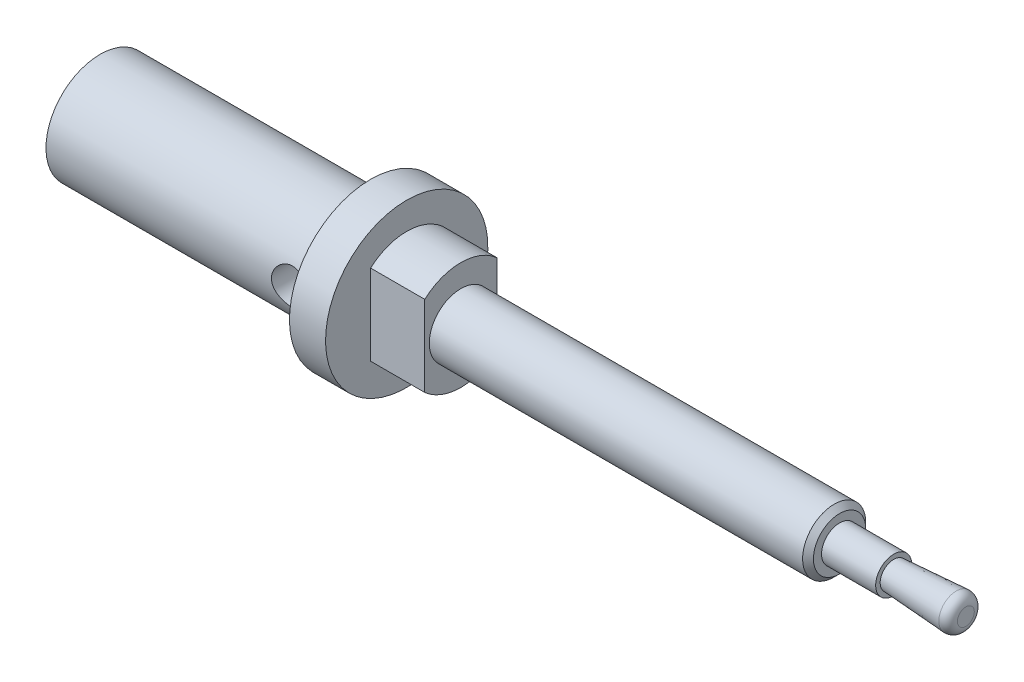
from build123d import *

# Parameters (mm, degrees)
CONG_1_R                     = 0.5
CHANFREIN1_SIZE              = 0.3
ENL_V_MAT_EXTRU_1_DEPTH      = 3
D_GAGEMENT_M41_D             = 4
D_GAGEMENT_M41_DEPTH         = 10
D_GAGEMENT_M41_TIP           = 1.201721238
ENL_V_MAT_EXTRU_2_DEPTH      = 34.608034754
ENL_V_MAT_EXTRU_2_DEPTH_BACK = 34.608034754
ESQUISSE5_R                  = 1


with BuildPart() as part:
    # Esquisse1 → R_volution1 (revolve)
    with BuildSketch(Plane.XY):
        Polygon((-15, 0), (-15, 3), (0, 3), (0, 4.5), (2, 4.5), (2, 3), (5, 3), (5, 1.75), (26, 1.75), (26, 1), (29, 1), (29, 0.75), (33, 1), (33, 0), align=None)
    revolve(axis=Axis((33, 0, 0), (-1, 0, 0)))

    # Cong_1
    cong_1_edges = [part.edges().sort_by_distance(p)[0] for p in [
        (33, -1, 0),
    ]]
    fillet(cong_1_edges, radius=CONG_1_R)

    # Chanfrein1
    chanfrein1_edges = [part.edges().sort_by_distance(p)[0] for p in [
        (26, -1.75, 0),
    ]]
    chamfer(chanfrein1_edges, length=CHANFREIN1_SIZE)

    # Esquisse2 → Enl_v. mat.-Extru.1 (cut)
    with BuildSketch(Plane(origin=(5, 0, 0), x_dir=(0, 0, -1), z_dir=(1, 0, 0))):
        with BuildLine():
            Line((-2, -2.236067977), (-2, 2.236067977))
            ThreePointArc((-2, 2.236067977), (-3, 0), (-2, -2.236067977))
        make_face()
        with BuildLine():
            Line((2, -2.236067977), (2, 2.236067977))
            ThreePointArc((2, 2.236067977), (3, 0), (2, -2.236067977))
        make_face()
    extrude(amount=-ENL_V_MAT_EXTRU_1_DEPTH, mode=Mode.SUBTRACT)

    # D_gagement M41
    with Locations(Plane.ZY.offset(15)):
        with Locations((0, 0)):
            Hole(D_GAGEMENT_M41_D / 2, depth=D_GAGEMENT_M41_DEPTH)
            with Locations((0, 0, -(D_GAGEMENT_M41_DEPTH + D_GAGEMENT_M41_TIP / 2))):  # 118° drill point
                Cone(0, D_GAGEMENT_M41_D / 2, D_GAGEMENT_M41_TIP, mode=Mode.SUBTRACT)

    # Esquisse5 → Enl_v. mat.-Extru.2 (cut, two sides: drawn at the far end of the back side and taken through both)
    with BuildSketch(Plane.XY.offset(-ENL_V_MAT_EXTRU_2_DEPTH_BACK)):
        with Locations((-1.5, 0)):
            Circle(ESQUISSE5_R)
    extrude(amount=ENL_V_MAT_EXTRU_2_DEPTH + ENL_V_MAT_EXTRU_2_DEPTH_BACK, mode=Mode.SUBTRACT)


solid = part.part
